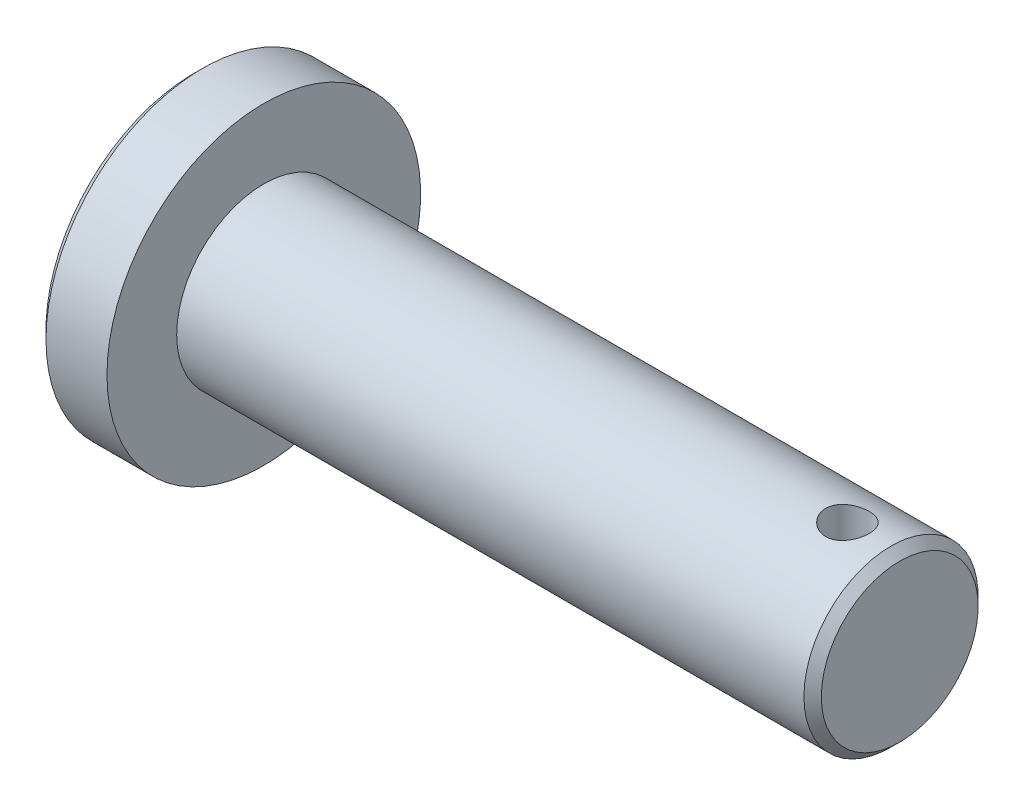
from build123d import *

# Parameters (mm, degrees)
ENL_V_MAT_EXTRU_1_DEPTH      = 85.905830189
ENL_V_MAT_EXTRU_1_DEPTH_BACK = 85.905830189
ESQUISSE2_R                  = 2.5
CHANFREIN1_SIZE              = 1


with BuildPart() as part:
    # Esquisse1 → R_volution1 (revolve)
    with BuildSketch(Plane.XY, mode=Mode.PRIVATE) as r_volution1_sk:
        Polygon((0, 0), (0, 18), (8, 18), (8, 10), (81, 10), (81, 0), align=None)
    revolve(r_volution1_sk.sketch.rotate(Axis((-47.005255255, 0, 0), (1, 0, 0)), 90), axis=Axis((-47.005255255, 0, 0), (1, 0, 0)))

    # Esquisse2 → Enl_v. mat.-Extru.1 (cut, two sides: drawn at the far end of the back side and taken through both)
    with BuildSketch(Plane(origin=(0, 0, 0), x_dir=(1, 0, 0), z_dir=(0, 1, 0)).offset(-ENL_V_MAT_EXTRU_1_DEPTH_BACK)):
        with Locations(Location((75, 0, 0), (0, 0, 270))):
            Circle(ESQUISSE2_R)
    extrude(amount=ENL_V_MAT_EXTRU_1_DEPTH + ENL_V_MAT_EXTRU_1_DEPTH_BACK, mode=Mode.SUBTRACT)

    # Chanfrein1
    chanfrein1_edges = [part.edges().sort_by_distance(p)[0] for p in [
        (81, 0, -10),
        (0, 0, -18),
    ]]
    chamfer(chanfrein1_edges, length=CHANFREIN1_SIZE)


solid = part.part
